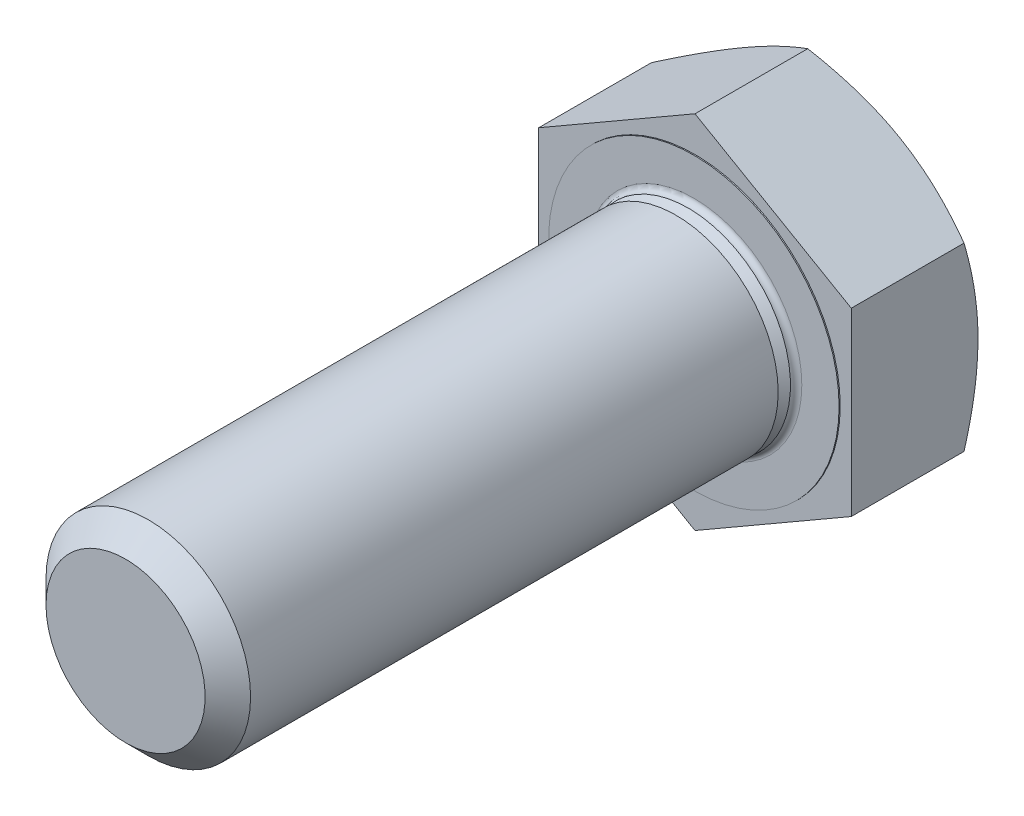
ISO-10303-21;
HEADER;
FILE_DESCRIPTION(('STEP AP214'),'2;1');
FILE_NAME('part.step','',(''),(''),'','','');
FILE_SCHEMA(('AUTOMOTIVE_DESIGN { 1 0 10303 214 1 1 1 1 }'));
ENDSEC;
DATA;
#1=APPLICATION_CONTEXT('core data for automotive mechanical design processes');
#2=APPLICATION_PROTOCOL_DEFINITION('international standard','automotive_design',2000,#1);
#3=PRODUCT_CONTEXT('',#1,'mechanical');
#4=PRODUCT('Part','Part','',(#3));
#5=PRODUCT_RELATED_PRODUCT_CATEGORY('part','',(#4));
#6=PRODUCT_DEFINITION_FORMATION('','',#4);
#7=PRODUCT_DEFINITION_CONTEXT('part definition',#1,'design');
#8=PRODUCT_DEFINITION('design','',#6,#7);
#9=PRODUCT_DEFINITION_SHAPE('','',#8);
#10=(LENGTH_UNIT() NAMED_UNIT(*) SI_UNIT(.MILLI.,.METRE.));
#11=(NAMED_UNIT(*) PLANE_ANGLE_UNIT() SI_UNIT($,.RADIAN.));
#12=(NAMED_UNIT(*) SI_UNIT($,.STERADIAN.) SOLID_ANGLE_UNIT());
#13=UNCERTAINTY_MEASURE_WITH_UNIT(LENGTH_MEASURE(1.E-05),#10,'distance_accuracy_value','');
#14=(GEOMETRIC_REPRESENTATION_CONTEXT(3) GLOBAL_UNCERTAINTY_ASSIGNED_CONTEXT((#13)) GLOBAL_UNIT_ASSIGNED_CONTEXT((#10,
#11,#12)) REPRESENTATION_CONTEXT('',''));
#15=CARTESIAN_POINT('',(0.,0.,0.));
#16=DIRECTION('',(0.,0.,1.));
#17=DIRECTION('',(1.,0.,0.));
#18=AXIS2_PLACEMENT_3D('',#15,#16,#17);
#19=CARTESIAN_POINT('',(2.13097768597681E-11,-13.7499999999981,-22.5000000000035));
#20=DIRECTION('',(0.,0.,-0.999999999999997));
#21=DIRECTION('',(-0.999999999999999,0.,0.));
#22=AXIS2_PLACEMENT_3D('',#19,#20,#21);
#23=PLANE('',#22);
#24=CARTESIAN_POINT('',(1.42030484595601E-11,0.,-22.5));
#25=DIRECTION('',(0.,0.,0.999999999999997));
#26=DIRECTION('',(0.999999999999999,0.,0.));
#27=AXIS2_PLACEMENT_3D('',#24,#25,#26);
#28=CIRCLE('',#27,27.5);
#29=CARTESIAN_POINT('',(27.5000000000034,3.55618312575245E-12,-22.4999999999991));
#30=VERTEX_POINT('',#29);
#31=CARTESIAN_POINT('',(13.7500000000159,23.8156986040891,-22.5000000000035));
#32=VERTEX_POINT('',#31);
#33=EDGE_CURVE('E115',#30,#32,#28,.T.);
#34=ORIENTED_EDGE('',*,*,#33,.F.);
#35=CARTESIAN_POINT('',(1.42030484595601E-11,0.,-22.5));
#36=DIRECTION('',(0.,0.,0.999999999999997));
#37=DIRECTION('',(0.999999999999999,0.,0.));
#38=AXIS2_PLACEMENT_3D('',#35,#36,#37);
#39=CIRCLE('',#38,27.5);
#40=CARTESIAN_POINT('',(13.7500000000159,-23.8156986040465,-22.5000000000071));
#41=VERTEX_POINT('',#40);
#42=EDGE_CURVE('E133',#41,#30,#39,.T.);
#43=ORIENTED_EDGE('',*,*,#42,.F.);
#44=CARTESIAN_POINT('',(1.42030484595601E-11,0.,-22.5));
#45=DIRECTION('',(0.,0.,0.999999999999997));
#46=DIRECTION('',(0.999999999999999,0.,0.));
#47=AXIS2_PLACEMENT_3D('',#44,#45,#46);
#48=CIRCLE('',#47,27.5);
#49=CARTESIAN_POINT('',(-13.7499999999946,-23.8156986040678,-22.4999999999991));
#50=VERTEX_POINT('',#49);
#51=EDGE_CURVE('E120',#50,#41,#48,.T.);
#52=ORIENTED_EDGE('',*,*,#51,.F.);
#53=CARTESIAN_POINT('',(1.42030484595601E-11,0.,-22.5));
#54=DIRECTION('',(0.,0.,0.999999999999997));
#55=DIRECTION('',(0.,-1.00000000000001,0.));
#56=AXIS2_PLACEMENT_3D('',#53,#54,#55);
#57=CIRCLE('',#56,27.5);
#58=CARTESIAN_POINT('',(-27.499999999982,1.78242837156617E-12,-22.5000000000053));
#59=VERTEX_POINT('',#58);
#60=EDGE_CURVE('E129',#59,#50,#57,.T.);
#61=ORIENTED_EDGE('',*,*,#60,.F.);
#62=CARTESIAN_POINT('',(1.42030484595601E-11,0.,-22.5));
#63=DIRECTION('',(0.,0.,0.999999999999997));
#64=DIRECTION('',(0.999999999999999,0.,0.));
#65=AXIS2_PLACEMENT_3D('',#62,#63,#64);
#66=CIRCLE('',#65,27.5);
#67=CARTESIAN_POINT('',(-13.7499999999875,23.8156986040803,-22.4999999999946));
#68=VERTEX_POINT('',#67);
#69=EDGE_CURVE('E130',#68,#59,#66,.T.);
#70=ORIENTED_EDGE('',*,*,#69,.F.);
#71=CARTESIAN_POINT('',(1.42030484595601E-11,0.,-22.5));
#72=DIRECTION('',(0.,0.,0.999999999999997));
#73=DIRECTION('',(0.999999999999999,0.,0.));
#74=AXIS2_PLACEMENT_3D('',#71,#72,#73);
#75=CIRCLE('',#74,27.5);
#76=EDGE_CURVE('E480',#32,#68,#75,.T.);
#77=ORIENTED_EDGE('',*,*,#76,.F.);
#78=EDGE_LOOP('',(#34,#43,#52,#61,#70,#77));
#79=FACE_BOUND('',#78,.T.);
#80=ADVANCED_FACE('F38',(#79),#23,.T.);
#81=CARTESIAN_POINT('',(7.09892214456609E-12,0.,-20.0290618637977));
#82=DIRECTION('',(0.,0.,0.999999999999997));
#83=DIRECTION('',(0.999999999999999,0.,0.));
#84=AXIS2_PLACEMENT_3D('',#81,#82,#83);
#85=CONICAL_SURFACE('',#84,31.779790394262,1.0471975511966);
#86=CARTESIAN_POINT('',(13.7500000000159,-23.8156986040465,-22.5000000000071));
#87=CARTESIAN_POINT('',(14.0418053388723,-23.6472247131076,-22.5000051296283));
#88=CARTESIAN_POINT('',(14.3336015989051,-23.4787560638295,-22.4964238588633));
#89=CARTESIAN_POINT('',(14.9170590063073,-23.1418967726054,-22.4821352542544));
#90=CARTESIAN_POINT('',(15.2087201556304,-22.9735061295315,-22.4714280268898));
#91=CARTESIAN_POINT('',(16.0831949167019,-22.4686278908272,-22.4286943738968));
#92=CARTESIAN_POINT('',(16.6656437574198,-22.1323508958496,-22.3860559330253));
#93=CARTESIAN_POINT('',(17.8256170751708,-21.4626399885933,-22.2737114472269));
#94=CARTESIAN_POINT('',(18.4031516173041,-21.1292002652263,-22.2041416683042));
#95=CARTESIAN_POINT('',(19.5554773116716,-20.4639047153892,-22.0393870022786));
#96=CARTESIAN_POINT('',(20.1302683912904,-20.1320489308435,-21.9442014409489));
#97=CARTESIAN_POINT('',(21.2758049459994,-19.4706730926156,-21.7301676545));
#98=CARTESIAN_POINT('',(21.8465544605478,-19.1411507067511,-21.6113480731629));
#99=CARTESIAN_POINT('',(22.9843587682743,-18.4842390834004,-21.3519872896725));
#100=CARTESIAN_POINT('',(23.5514133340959,-18.1568499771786,-21.2114447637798));
#101=CARTESIAN_POINT('',(24.6844797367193,-17.502673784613,-20.9099695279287));
#102=CARTESIAN_POINT('',(25.2504713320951,-17.1758983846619,-20.7489360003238));
#103=CARTESIAN_POINT('',(26.3783128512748,-16.5247387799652,-20.4091478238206));
#104=CARTESIAN_POINT('',(26.9401637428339,-16.200354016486,-20.2303974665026));
#105=CARTESIAN_POINT('',(27.5000000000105,-15.8771324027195,-20.0437990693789));
#106=B_SPLINE_CURVE_WITH_KNOTS('',3,(#86,#87,#88,#89,#90,#91,#92,#93,#94,#95,#96,#97,#98,#99,
#100,#101,#102,#103,#104,#105),.UNSPECIFIED.,.F.,.F.,(4,2,2,2,2,2,2,2,2,4),(0.,1.01080374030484,
2.02159237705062,4.04267151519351,6.0536554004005,8.06469222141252,10.0733064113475,
12.0820430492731,14.1010754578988,16.1196199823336),.UNSPECIFIED.);
#107=CARTESIAN_POINT('',(27.5000000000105,-15.8771324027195,-20.0437990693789));
#108=VERTEX_POINT('',#107);
#109=EDGE_CURVE('E140',#41,#108,#106,.T.);
#110=ORIENTED_EDGE('',*,*,#109,.F.);
#111=ORIENTED_EDGE('',*,*,#42,.T.);
#112=CARTESIAN_POINT('',(27.5000000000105,-15.8771324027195,-20.0437990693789));
#113=CARTESIAN_POINT('',(27.4999999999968,-15.2306891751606,-20.2303974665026));
#114=CARTESIAN_POINT('',(27.4999999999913,-14.5819196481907,-20.4091478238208));
#115=CARTESIAN_POINT('',(27.4999999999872,-13.2796004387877,-20.7489360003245));
#116=CARTESIAN_POINT('',(27.4999999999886,-12.626049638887,-20.9099695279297));
#117=CARTESIAN_POINT('',(27.4999999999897,-11.3176972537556,-21.2114447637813));
#118=CARTESIAN_POINT('',(27.4999999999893,-10.6629190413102,-21.3519872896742));
#119=CARTESIAN_POINT('',(27.499999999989,-9.34909579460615,-21.6113480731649));
#120=CARTESIAN_POINT('',(27.4999999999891,-8.69005102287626,-21.7301676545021));
#121=CARTESIAN_POINT('',(27.4999999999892,-7.36729934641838,-21.9442014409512));
#122=CARTESIAN_POINT('',(27.4999999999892,-6.70358777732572,-22.0393870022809));
#123=CARTESIAN_POINT('',(27.4999999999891,-5.37299667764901,-22.2041416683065));
#124=CARTESIAN_POINT('',(27.4999999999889,-4.70611723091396,-22.2737114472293));
#125=CARTESIAN_POINT('',(27.4999999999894,-3.36669541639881,-22.3860559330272));
#126=CARTESIAN_POINT('',(27.4999999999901,-2.69414142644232,-22.4286943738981));
#127=CARTESIAN_POINT('',(27.4999999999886,-1.68438494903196,-22.4714280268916));
#128=CARTESIAN_POINT('',(27.4999999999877,-1.34760366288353,-22.4821352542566));
#129=CARTESIAN_POINT('',(27.4999999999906,-0.673885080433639,-22.4964238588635));
#130=CARTESIAN_POINT('',(27.4999999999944,-0.336947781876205,-22.500005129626));
#131=CARTESIAN_POINT('',(27.5000000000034,3.55618312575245E-12,-22.4999999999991));
#132=B_SPLINE_CURVE_WITH_KNOTS('',3,(#112,#113,#114,#115,#116,#117,#118,#119,#120,#121,#122,
#123,#124,#125,#126,#127,#128,#129,#130,#131),.UNSPECIFIED.,.F.,.F.,(4,2,2,2,2,2,2,2,2,4),(0.,
2.01854452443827,4.03757693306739,6.04631357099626,8.05492776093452,10.0659645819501,
12.0769484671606,14.0980276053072,15.1088162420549,16.1196199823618),.UNSPECIFIED.);
#133=EDGE_CURVE('E142',#108,#30,#132,.T.);
#134=ORIENTED_EDGE('',*,*,#133,.F.);
#135=EDGE_LOOP('',(#110,#111,#134));
#136=FACE_BOUND('',#135,.T.);
#137=ADVANCED_FACE('F141',(#136),#85,.T.);
#138=CARTESIAN_POINT('',(7.09892214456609E-12,0.,-20.0290618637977));
#139=DIRECTION('',(0.,0.,0.999999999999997));
#140=DIRECTION('',(0.999999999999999,0.,0.));
#141=AXIS2_PLACEMENT_3D('',#138,#139,#140);
#142=CONICAL_SURFACE('',#141,31.779790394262,1.0471975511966);
#143=ORIENTED_EDGE('',*,*,#33,.T.);
#144=CARTESIAN_POINT('',(27.5000000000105,15.8771324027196,-20.0437990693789));
#145=CARTESIAN_POINT('',(26.9401637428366,16.2003540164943,-20.2303974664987));
#146=CARTESIAN_POINT('',(26.3783128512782,16.5247387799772,-20.4091478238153));
#147=CARTESIAN_POINT('',(25.2504713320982,17.175898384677,-20.7489360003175));
#148=CARTESIAN_POINT('',(24.6844797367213,17.5026737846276,-20.9099695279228));
#149=CARTESIAN_POINT('',(23.5514133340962,18.1568499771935,-21.2114447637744));
#150=CARTESIAN_POINT('',(22.984358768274,18.484239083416,-21.3519872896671));
#151=CARTESIAN_POINT('',(21.8465544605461,19.1411507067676,-21.6113480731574));
#152=CARTESIAN_POINT('',(21.2758049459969,19.4706730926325,-21.7301676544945));
#153=CARTESIAN_POINT('',(20.1302683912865,20.1320489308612,-21.9442014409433));
#154=CARTESIAN_POINT('',(19.5554773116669,20.4639047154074,-22.039387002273));
#155=CARTESIAN_POINT('',(18.4031516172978,21.1292002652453,-22.2041416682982));
#156=CARTESIAN_POINT('',(17.8256170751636,21.4626399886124,-22.2737114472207));
#157=CARTESIAN_POINT('',(16.6656437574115,22.1323508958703,-22.386055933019));
#158=CARTESIAN_POINT('',(16.0831949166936,22.4686278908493,-22.4286943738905));
#159=CARTESIAN_POINT('',(15.2087201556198,22.9735061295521,-22.4714280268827));
#160=CARTESIAN_POINT('',(14.9170590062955,23.1418967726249,-22.4821352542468));
#161=CARTESIAN_POINT('',(14.3336015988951,23.4787560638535,-22.4964238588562));
#162=CARTESIAN_POINT('',(14.0418053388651,23.6472247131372,-22.5000051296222));
#163=CARTESIAN_POINT('',(13.7500000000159,23.8156986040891,-22.5000000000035));
#164=B_SPLINE_CURVE_WITH_KNOTS('',3,(#144,#145,#146,#147,#148,#149,#150,#151,#152,#153,#154,
#155,#156,#157,#158,#159,#160,#161,#162,#163),.UNSPECIFIED.,.F.,.F.,(4,2,2,2,2,2,2,2,2,4),(0.,
2.01854452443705,4.03757693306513,6.0463135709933,8.05492776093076,10.0659645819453,
12.0769484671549,14.0980276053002,15.1088162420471,16.119619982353),.UNSPECIFIED.);
#165=CARTESIAN_POINT('',(27.5000000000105,15.8771324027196,-20.0437990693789));
#166=VERTEX_POINT('',#165);
#167=EDGE_CURVE('E262',#166,#32,#164,.T.);
#168=ORIENTED_EDGE('',*,*,#167,.F.);
#169=CARTESIAN_POINT('',(27.5000000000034,3.55618312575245E-12,-22.4999999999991));
#170=CARTESIAN_POINT('',(27.4999999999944,0.33694778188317,-22.5000051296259));
#171=CARTESIAN_POINT('',(27.4999999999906,0.673885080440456,-22.4964238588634));
#172=CARTESIAN_POINT('',(27.4999999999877,1.34760366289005,-22.4821352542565));
#173=CARTESIAN_POINT('',(27.4999999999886,1.68438494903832,-22.4714280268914));
#174=CARTESIAN_POINT('',(27.4999999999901,2.69414142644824,-22.4286943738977));
#175=CARTESIAN_POINT('',(27.4999999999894,3.36669541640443,-22.3860559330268));
#176=CARTESIAN_POINT('',(27.4999999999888,4.70611723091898,-22.2737114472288));
#177=CARTESIAN_POINT('',(27.499999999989,5.37299667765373,-22.204141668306));
#178=CARTESIAN_POINT('',(27.4999999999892,6.70358777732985,-22.0393870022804));
#179=CARTESIAN_POINT('',(27.4999999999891,7.36729934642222,-21.9442014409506));
#180=CARTESIAN_POINT('',(27.499999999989,8.69005102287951,-21.7301676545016));
#181=CARTESIAN_POINT('',(27.4999999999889,9.34909579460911,-21.6113480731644));
#182=CARTESIAN_POINT('',(27.4999999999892,10.6629190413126,-21.3519872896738));
#183=CARTESIAN_POINT('',(27.4999999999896,11.3176972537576,-21.2114447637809));
#184=CARTESIAN_POINT('',(27.4999999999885,12.6260496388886,-20.9099695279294));
#185=CARTESIAN_POINT('',(27.499999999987,13.2796004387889,-20.7489360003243));
#186=CARTESIAN_POINT('',(27.4999999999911,14.5819196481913,-20.4091478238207));
#187=CARTESIAN_POINT('',(27.4999999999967,15.2306891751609,-20.2303974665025));
#188=CARTESIAN_POINT('',(27.5000000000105,15.8771324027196,-20.0437990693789));
#189=B_SPLINE_CURVE_WITH_KNOTS('',3,(#169,#170,#171,#172,#173,#174,#175,#176,#177,#178,#179,
#180,#181,#182,#183,#184,#185,#186,#187,#188),.UNSPECIFIED.,.F.,.F.,(4,2,2,2,2,2,2,2,2,4),(0.,
1.01080374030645,2.02159237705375,4.0426715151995,6.05365540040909,8.06469222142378,
10.0733064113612,12.0820430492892,14.1010754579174,16.1196199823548),.UNSPECIFIED.);
#190=EDGE_CURVE('E151',#30,#166,#189,.T.);
#191=ORIENTED_EDGE('',*,*,#190,.F.);
#192=EDGE_LOOP('',(#143,#168,#191));
#193=FACE_BOUND('',#192,.T.);
#194=ADVANCED_FACE('F254',(#193),#142,.T.);
#195=CARTESIAN_POINT('',(7.09892214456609E-12,0.,-20.0290618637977));
#196=DIRECTION('',(0.,0.,0.999999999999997));
#197=DIRECTION('',(0.999999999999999,0.,0.));
#198=AXIS2_PLACEMENT_3D('',#195,#196,#197);
#199=CONICAL_SURFACE('',#198,31.779790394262,1.0471975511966);
#200=ORIENTED_EDGE('',*,*,#76,.T.);
#201=CARTESIAN_POINT('',(7.07810546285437E-12,31.754264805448,-20.0437990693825));
#202=CARTESIAN_POINT('',(-0.559836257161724,31.4310431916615,-20.2303974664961));
#203=CARTESIAN_POINT('',(-1.12168714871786,31.1066584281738,-20.4091478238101));
#204=CARTESIAN_POINT('',(-2.24952866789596,30.4554988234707,-20.7489360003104));
#205=CARTESIAN_POINT('',(-2.81552026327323,30.1287234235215,-20.9099695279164));
#206=CARTESIAN_POINT('',(-3.94858666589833,29.4745472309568,-21.2114447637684));
#207=CARTESIAN_POINT('',(-4.51564123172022,29.1471581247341,-21.3519872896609));
#208=CARTESIAN_POINT('',(-5.65344553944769,28.4902465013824,-21.6113480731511));
#209=CARTESIAN_POINT('',(-6.22419505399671,28.1607241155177,-21.7301676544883));
#210=CARTESIAN_POINT('',(-7.36973160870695,27.4993482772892,-21.9442014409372));
#211=CARTESIAN_POINT('',(-7.94452268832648,27.1674924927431,-22.0393870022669));
#212=CARTESIAN_POINT('',(-9.09684838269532,26.5021969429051,-22.2041416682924));
#213=CARTESIAN_POINT('',(-9.67438292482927,26.1687572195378,-22.2737114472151));
#214=CARTESIAN_POINT('',(-10.8343562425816,25.4990463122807,-22.3860559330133));
#215=CARTESIAN_POINT('',(-11.4168050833,25.1627693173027,-22.4286943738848));
#216=CARTESIAN_POINT('',(-12.2912798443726,24.657891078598,-22.4714280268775));
#217=CARTESIAN_POINT('',(-12.5829409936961,24.489500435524,-22.482135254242));
#218=CARTESIAN_POINT('',(-13.1663984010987,24.1526411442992,-22.4964238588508));
#219=CARTESIAN_POINT('',(-13.4581946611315,23.9841724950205,-22.5000051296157));
#220=CARTESIAN_POINT('',(-13.7499999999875,23.8156986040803,-22.4999999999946));
#221=B_SPLINE_CURVE_WITH_KNOTS('',3,(#201,#202,#203,#204,#205,#206,#207,#208,#209,#210,#211,
#212,#213,#214,#215,#216,#217,#218,#219,#220),.UNSPECIFIED.,.F.,.F.,(4,2,2,2,2,2,2,2,2,4),(0.,
2.01854452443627,4.03757693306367,6.04631357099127,8.05492776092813,10.0659645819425,
12.0769484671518,14.0980276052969,15.1088162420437,16.1196199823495),.UNSPECIFIED.);
#222=CARTESIAN_POINT('',(7.07810546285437E-12,31.754264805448,-20.0437990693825));
#223=VERTEX_POINT('',#222);
#224=EDGE_CURVE('E238',#223,#68,#221,.T.);
#225=ORIENTED_EDGE('',*,*,#224,.F.);
#226=CARTESIAN_POINT('',(13.7500000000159,23.8156986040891,-22.5000000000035));
#227=CARTESIAN_POINT('',(13.4581946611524,23.9841724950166,-22.5000051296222));
#228=CARTESIAN_POINT('',(13.1663984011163,24.15264114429,-22.4964238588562));
#229=CARTESIAN_POINT('',(12.5829409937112,24.4895004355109,-22.4821352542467));
#230=CARTESIAN_POINT('',(12.2912798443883,24.6578910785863,-22.4714280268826));
#231=CARTESIAN_POINT('',(11.4168050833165,25.1627693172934,-22.4286943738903));
#232=CARTESIAN_POINT('',(10.8343562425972,25.4990463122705,-22.3860559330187));
#233=CARTESIAN_POINT('',(9.67438292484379,26.1687572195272,-22.2737114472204));
#234=CARTESIAN_POINT('',(9.09684838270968,26.502196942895,-22.2041416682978));
#235=CARTESIAN_POINT('',(7.94452268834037,27.1674924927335,-22.0393870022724));
#236=CARTESIAN_POINT('',(7.36973160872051,27.4993482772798,-21.9442014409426));
#237=CARTESIAN_POINT('',(6.22419505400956,28.1607241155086,-21.7301676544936));
#238=CARTESIAN_POINT('',(5.65344553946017,28.4902465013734,-21.6113480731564));
#239=CARTESIAN_POINT('',(4.51564123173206,29.1471581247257,-21.3519872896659));
#240=CARTESIAN_POINT('',(3.94858666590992,29.4745472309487,-21.2114447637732));
#241=CARTESIAN_POINT('',(2.81552026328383,30.1287234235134,-20.9099695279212));
#242=CARTESIAN_POINT('',(2.24952866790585,30.4554988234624,-20.7489360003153));
#243=CARTESIAN_POINT('',(1.12168714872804,31.1066584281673,-20.4091478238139));
#244=CARTESIAN_POINT('',(0.559836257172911,31.4310431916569,-20.2303974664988));
#245=CARTESIAN_POINT('',(7.07810546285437E-12,31.754264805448,-20.0437990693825));
#246=B_SPLINE_CURVE_WITH_KNOTS('',3,(#226,#227,#228,#229,#230,#231,#232,#233,#234,#235,#236,
#237,#238,#239,#240,#241,#242,#243,#244,#245),.UNSPECIFIED.,.F.,.F.,(4,2,2,2,2,2,2,2,2,4),(0.,
1.01080374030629,2.02159237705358,4.04267151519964,6.05365540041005,8.06469222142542,
10.0733064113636,12.0820430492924,14.1010754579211,16.1196199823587),.UNSPECIFIED.);
#247=EDGE_CURVE('E246',#32,#223,#246,.T.);
#248=ORIENTED_EDGE('',*,*,#247,.F.);
#249=EDGE_LOOP('',(#200,#225,#248));
#250=FACE_BOUND('',#249,.T.);
#251=ADVANCED_FACE('F251',(#250),#199,.T.);
#252=CARTESIAN_POINT('',(7.09892214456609E-12,0.,-20.0290618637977));
#253=DIRECTION('',(0.,0.,0.999999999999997));
#254=DIRECTION('',(0.999999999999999,0.,0.));
#255=AXIS2_PLACEMENT_3D('',#252,#253,#254);
#256=CONICAL_SURFACE('',#255,31.779790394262,1.0471975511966);
#257=ORIENTED_EDGE('',*,*,#69,.T.);
#258=CARTESIAN_POINT('',(-27.4999999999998,15.8771324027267,-20.0437990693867));
#259=CARTESIAN_POINT('',(-27.5000000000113,15.2306891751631,-20.2303974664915));
#260=CARTESIAN_POINT('',(-27.5000000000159,14.5819196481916,-20.4091478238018));
#261=CARTESIAN_POINT('',(-27.5000000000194,13.2796004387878,-20.7489360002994));
#262=CARTESIAN_POINT('',(-27.5000000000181,12.626049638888,-20.9099695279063));
#263=CARTESIAN_POINT('',(-27.5000000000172,11.3176972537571,-21.211444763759));
#264=CARTESIAN_POINT('',(-27.5000000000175,10.6629190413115,-21.3519872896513));
#265=CARTESIAN_POINT('',(-27.5000000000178,9.34909579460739,-21.6113480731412));
#266=CARTESIAN_POINT('',(-27.5000000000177,8.69005102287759,-21.7301676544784));
#267=CARTESIAN_POINT('',(-27.5000000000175,7.36729934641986,-21.9442014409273));
#268=CARTESIAN_POINT('',(-27.5000000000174,6.70358777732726,-22.039387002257));
#269=CARTESIAN_POINT('',(-27.5000000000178,5.37299667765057,-22.204141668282));
#270=CARTESIAN_POINT('',(-27.5000000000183,4.70611723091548,-22.2737114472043));
#271=CARTESIAN_POINT('',(-27.5000000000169,3.36669541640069,-22.3860559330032));
#272=CARTESIAN_POINT('',(-27.5000000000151,2.69414142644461,-22.4286943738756));
#273=CARTESIAN_POINT('',(-27.5000000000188,1.68438494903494,-22.4714280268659));
#274=CARTESIAN_POINT('',(-27.5000000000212,1.34760366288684,-22.4821352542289));
#275=CARTESIAN_POINT('',(-27.500000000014,0.673885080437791,-22.4964238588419));
#276=CARTESIAN_POINT('',(-27.5000000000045,0.336947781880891,-22.5000051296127));
#277=CARTESIAN_POINT('',(-27.499999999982,1.78242837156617E-12,-22.5000000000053));
#278=B_SPLINE_CURVE_WITH_KNOTS('',3,(#258,#259,#260,#261,#262,#263,#264,#265,#266,#267,#268,
#269,#270,#271,#272,#273,#274,#275,#276,#277),.UNSPECIFIED.,.F.,.F.,(4,2,2,2,2,2,2,2,2,4),(0.,
2.01854452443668,4.03757693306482,6.04631357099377,8.05492776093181,10.0659645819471,
12.0769484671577,14.0980276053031,15.1088162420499,16.1196199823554),.UNSPECIFIED.);
#279=CARTESIAN_POINT('',(-27.4999999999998,15.8771324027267,-20.0437990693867));
#280=VERTEX_POINT('',#279);
#281=EDGE_CURVE('E223',#280,#59,#278,.T.);
#282=ORIENTED_EDGE('',*,*,#281,.F.);
#283=CARTESIAN_POINT('',(-13.7499999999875,23.8156986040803,-22.4999999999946));
#284=CARTESIAN_POINT('',(-14.0418053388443,23.647224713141,-22.5000051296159));
#285=CARTESIAN_POINT('',(-14.3336015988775,23.4787560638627,-22.496423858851));
#286=CARTESIAN_POINT('',(-14.9170590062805,23.1418967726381,-22.4821352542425));
#287=CARTESIAN_POINT('',(-15.2087201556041,22.9735061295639,-22.4714280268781));
#288=CARTESIAN_POINT('',(-16.083194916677,22.4686278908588,-22.4286943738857));
#289=CARTESIAN_POINT('',(-16.6656437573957,22.1323508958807,-22.3860559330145));
#290=CARTESIAN_POINT('',(-17.8256170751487,21.4626399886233,-22.2737114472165));
#291=CARTESIAN_POINT('',(-18.4031516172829,21.1292002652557,-22.204141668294));
#292=CARTESIAN_POINT('',(-19.5554773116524,20.4639047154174,-22.0393870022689));
#293=CARTESIAN_POINT('',(-20.1302683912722,20.1320489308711,-21.9442014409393));
#294=CARTESIAN_POINT('',(-21.275804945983,19.4706730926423,-21.7301676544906));
#295=CARTESIAN_POINT('',(-21.8465544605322,19.1411507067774,-21.6113480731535));
#296=CARTESIAN_POINT('',(-22.9843587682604,18.4842390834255,-21.3519872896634));
#297=CARTESIAN_POINT('',(-23.5514133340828,18.156849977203,-21.211444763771));
#298=CARTESIAN_POINT('',(-24.6844797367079,17.5026737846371,-20.909969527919));
#299=CARTESIAN_POINT('',(-25.2504713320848,17.1758983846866,-20.7489360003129));
#300=CARTESIAN_POINT('',(-26.3783128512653,16.5247387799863,-20.409147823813));
#301=CARTESIAN_POINT('',(-26.9401637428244,16.2003540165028,-20.2303974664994));
#302=CARTESIAN_POINT('',(-27.4999999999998,15.8771324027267,-20.0437990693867));
#303=B_SPLINE_CURVE_WITH_KNOTS('',3,(#283,#284,#285,#286,#287,#288,#289,#290,#291,#292,#293,
#294,#295,#296,#297,#298,#299,#300,#301,#302),.UNSPECIFIED.,.F.,.F.,(4,2,2,2,2,2,2,2,2,4),(0.,
1.01080374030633,2.0215923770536,4.0426715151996,6.05365540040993,8.06469222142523,
10.073306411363,12.0820430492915,14.1010754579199,16.119619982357),.UNSPECIFIED.);
#304=EDGE_CURVE('E231',#68,#280,#303,.T.);
#305=ORIENTED_EDGE('',*,*,#304,.F.);
#306=EDGE_LOOP('',(#257,#282,#305));
#307=FACE_BOUND('',#306,.T.);
#308=ADVANCED_FACE('F181',(#307),#256,.T.);
#309=CARTESIAN_POINT('',(7.09892214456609E-12,0.,-20.0290618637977));
#310=DIRECTION('',(0.,0.,0.999999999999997));
#311=DIRECTION('',(0.999999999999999,0.,0.));
#312=AXIS2_PLACEMENT_3D('',#309,#310,#311);
#313=CONICAL_SURFACE('',#312,31.779790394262,1.0471975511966);
#314=CARTESIAN_POINT('',(-13.7499999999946,-23.8156986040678,-22.4999999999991));
#315=CARTESIAN_POINT('',(-13.4581946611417,-23.9841724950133,-22.5000051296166));
#316=CARTESIAN_POINT('',(-13.1663984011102,-24.1526411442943,-22.4964238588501));
#317=CARTESIAN_POINT('',(-12.5829409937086,-24.4895004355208,-22.4821352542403));
#318=CARTESIAN_POINT('',(-12.2912798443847,-24.6578910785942,-22.4714280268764));
#319=CARTESIAN_POINT('',(-11.4168050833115,-25.1627693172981,-22.4286943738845));
#320=CARTESIAN_POINT('',(-10.8343562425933,-25.4990463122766,-22.3860559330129));
#321=CARTESIAN_POINT('',(-9.6743829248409,-26.1687572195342,-22.2737114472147));
#322=CARTESIAN_POINT('',(-9.09684838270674,-26.5021969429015,-22.2041416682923));
#323=CARTESIAN_POINT('',(-7.94452268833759,-27.1674924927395,-22.0393870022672));
#324=CARTESIAN_POINT('',(-7.36973160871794,-27.4993482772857,-21.9442014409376));
#325=CARTESIAN_POINT('',(-6.22419505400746,-28.1607241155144,-21.7301676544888));
#326=CARTESIAN_POINT('',(-5.65344553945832,-28.4902465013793,-21.6113480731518));
#327=CARTESIAN_POINT('',(-4.51564123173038,-29.147158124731,-21.3519872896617));
#328=CARTESIAN_POINT('',(-3.94858666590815,-29.4745472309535,-21.2114447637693));
#329=CARTESIAN_POINT('',(-2.81552026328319,-30.1287234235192,-20.9099695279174));
#330=CARTESIAN_POINT('',(-2.24952866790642,-30.4554988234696,-20.7489360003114));
#331=CARTESIAN_POINT('',(-1.12168714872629,-31.1066584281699,-20.4091478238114));
#332=CARTESIAN_POINT('',(-0.559836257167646,-31.4310431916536,-20.2303974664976));
#333=CARTESIAN_POINT('',(7.0833096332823E-12,-31.7542648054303,-20.0437990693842));
#334=B_SPLINE_CURVE_WITH_KNOTS('',3,(#314,#315,#316,#317,#318,#319,#320,#321,#322,#323,#324,
#325,#326,#327,#328,#329,#330,#331,#332,#333),.UNSPECIFIED.,.F.,.F.,(4,2,2,2,2,2,2,2,2,4),(0.,
1.01080374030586,2.02159237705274,4.04267151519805,6.05365540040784,8.06469222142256,
10.0733064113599,12.0820430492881,14.1010754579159,16.1196199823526),.UNSPECIFIED.);
#335=CARTESIAN_POINT('',(7.0833096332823E-12,-31.7542648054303,-20.0437990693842));
#336=VERTEX_POINT('',#335);
#337=EDGE_CURVE('E126',#50,#336,#334,.T.);
#338=ORIENTED_EDGE('',*,*,#337,.F.);
#339=ORIENTED_EDGE('',*,*,#51,.T.);
#340=CARTESIAN_POINT('',(7.0833096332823E-12,-31.7542648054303,-20.0437990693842));
#341=CARTESIAN_POINT('',(0.559836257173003,-31.4310431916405,-20.2303974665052));
#342=CARTESIAN_POINT('',(1.1216871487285,-31.1066584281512,-20.4091478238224));
#343=CARTESIAN_POINT('',(2.24952866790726,-30.4554988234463,-20.7489360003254));
#344=CARTESIAN_POINT('',(2.81552026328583,-30.1287234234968,-20.9099695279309));
#345=CARTESIAN_POINT('',(3.94858666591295,-29.4745472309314,-21.2114447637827));
#346=CARTESIAN_POINT('',(4.51564123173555,-29.1471581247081,-21.3519872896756));
#347=CARTESIAN_POINT('',(5.65344553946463,-28.4902465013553,-21.6113480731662));
#348=CARTESIAN_POINT('',(6.22419505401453,-28.1607241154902,-21.7301676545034));
#349=CARTESIAN_POINT('',(7.36973160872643,-27.4993482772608,-21.9442014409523));
#350=CARTESIAN_POINT('',(7.94452268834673,-27.1674924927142,-22.039387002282));
#351=CARTESIAN_POINT('',(9.09684838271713,-26.5021969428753,-22.2041416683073));
#352=CARTESIAN_POINT('',(9.67438292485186,-26.1687572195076,-22.2737114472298));
#353=CARTESIAN_POINT('',(10.8343562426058,-25.4990463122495,-22.3860559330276));
#354=CARTESIAN_POINT('',(11.4168050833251,-25.162769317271,-22.4286943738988));
#355=CARTESIAN_POINT('',(12.291279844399,-24.6578910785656,-22.4714280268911));
#356=CARTESIAN_POINT('',(12.5829409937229,-24.4895004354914,-22.4821352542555));
#357=CARTESIAN_POINT('',(13.1663984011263,-24.1526411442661,-22.4964238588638));
#358=CARTESIAN_POINT('',(13.4581946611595,-23.984172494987,-22.5000051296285));
#359=CARTESIAN_POINT('',(13.7500000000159,-23.8156986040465,-22.5000000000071));
#360=B_SPLINE_CURVE_WITH_KNOTS('',3,(#340,#341,#342,#343,#344,#345,#346,#347,#348,#349,#350,
#351,#352,#353,#354,#355,#356,#357,#358,#359),.UNSPECIFIED.,.F.,.F.,(4,2,2,2,2,2,2,2,2,4),(0.,
2.01854452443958,4.03757693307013,6.04631357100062,8.05492776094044,10.0659645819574,
12.0769484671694,14.0980276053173,15.1088162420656,16.1196199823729),.UNSPECIFIED.);
#361=EDGE_CURVE('E123',#336,#41,#360,.T.);
#362=ORIENTED_EDGE('',*,*,#361,.F.);
#363=EDGE_LOOP('',(#338,#339,#362));
#364=FACE_BOUND('',#363,.T.);
#365=ADVANCED_FACE('F121',(#364),#313,.T.);
#366=CARTESIAN_POINT('',(7.09892214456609E-12,0.,-20.0290618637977));
#367=DIRECTION('',(0.,0.,0.999999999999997));
#368=DIRECTION('',(0.,-1.00000000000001,0.));
#369=AXIS2_PLACEMENT_3D('',#366,#367,#368);
#370=CONICAL_SURFACE('',#369,31.779790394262,1.0471975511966);
#371=CARTESIAN_POINT('',(-27.499999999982,1.78242837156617E-12,-22.5000000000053));
#372=CARTESIAN_POINT('',(-27.5000000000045,-0.336947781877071,-22.5000051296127));
#373=CARTESIAN_POINT('',(-27.500000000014,-0.673885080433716,-22.496423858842));
#374=CARTESIAN_POINT('',(-27.5000000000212,-1.34760366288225,-22.482135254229));
#375=CARTESIAN_POINT('',(-27.5000000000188,-1.6843849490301,-22.4714280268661));
#376=CARTESIAN_POINT('',(-27.5000000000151,-2.69414142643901,-22.428694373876));
#377=CARTESIAN_POINT('',(-27.5000000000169,-3.36669541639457,-22.3860559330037));
#378=CARTESIAN_POINT('',(-27.5000000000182,-4.70611723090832,-22.273711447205));
#379=CARTESIAN_POINT('',(-27.5000000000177,-5.3729966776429,-22.2041416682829));
#380=CARTESIAN_POINT('',(-27.5000000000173,-6.70358777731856,-22.0393870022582));
#381=CARTESIAN_POINT('',(-27.5000000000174,-7.36729934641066,-21.9442014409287));
#382=CARTESIAN_POINT('',(-27.5000000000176,-8.69005102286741,-21.7301676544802));
#383=CARTESIAN_POINT('',(-27.5000000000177,-9.34909579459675,-21.6113480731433));
#384=CARTESIAN_POINT('',(-27.5000000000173,-10.6629190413,-21.3519872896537));
#385=CARTESIAN_POINT('',(-27.5000000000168,-11.3176972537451,-21.2114447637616));
#386=CARTESIAN_POINT('',(-27.5000000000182,-12.6260496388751,-20.9099695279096));
#387=CARTESIAN_POINT('',(-27.5000000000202,-13.2796004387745,-20.7489360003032));
#388=CARTESIAN_POINT('',(-27.5000000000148,-14.5819196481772,-20.4091478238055));
#389=CARTESIAN_POINT('',(-27.5000000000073,-15.2306891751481,-20.2303974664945));
#390=CARTESIAN_POINT('',(-27.4999999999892,-15.8771324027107,-20.0437990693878));
#391=B_SPLINE_CURVE_WITH_KNOTS('',3,(#371,#372,#373,#374,#375,#376,#377,#378,#379,#380,#381,
#382,#383,#384,#385,#386,#387,#388,#389,#390),.UNSPECIFIED.,.F.,.F.,(4,2,2,2,2,2,2,2,2,4),(0.,
1.01080374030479,2.02159237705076,4.04267151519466,6.05365540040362,8.06469222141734,
10.0733064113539,12.0820430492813,14.101075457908,16.1196199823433),.UNSPECIFIED.);
#392=CARTESIAN_POINT('',(-27.4999999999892,-15.8771324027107,-20.0437990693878));
#393=VERTEX_POINT('',#392);
#394=EDGE_CURVE('E200',#59,#393,#391,.T.);
#395=ORIENTED_EDGE('',*,*,#394,.F.);
#396=ORIENTED_EDGE('',*,*,#60,.T.);
#397=CARTESIAN_POINT('',(-27.4999999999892,-15.8771324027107,-20.0437990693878));
#398=CARTESIAN_POINT('',(-26.9401637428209,-16.2003540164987,-20.2303974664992));
#399=CARTESIAN_POINT('',(-26.3783128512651,-16.5247387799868,-20.4091478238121));
#400=CARTESIAN_POINT('',(-25.2504713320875,-17.1758983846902,-20.7489360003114));
#401=CARTESIAN_POINT('',(-24.6844797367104,-17.5026737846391,-20.9099695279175));
#402=CARTESIAN_POINT('',(-23.5514133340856,-18.1568499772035,-21.2114447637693));
#403=CARTESIAN_POINT('',(-22.9843587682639,-18.4842390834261,-21.3519872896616));
#404=CARTESIAN_POINT('',(-21.8465544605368,-19.1411507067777,-21.6113480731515));
#405=CARTESIAN_POINT('',(-21.275804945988,-19.4706730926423,-21.7301676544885));
#406=CARTESIAN_POINT('',(-20.1302683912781,-20.1320489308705,-21.9442014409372));
#407=CARTESIAN_POINT('',(-19.5554773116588,-20.4639047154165,-22.0393870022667));
#408=CARTESIAN_POINT('',(-18.4031516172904,-21.1292002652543,-22.2041416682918));
#409=CARTESIAN_POINT('',(-17.8256170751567,-21.4626399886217,-22.2737114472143));
#410=CARTESIAN_POINT('',(-16.6656437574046,-22.1323508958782,-22.3860559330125));
#411=CARTESIAN_POINT('',(-16.0831949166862,-22.4686278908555,-22.4286943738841));
#412=CARTESIAN_POINT('',(-15.2087201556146,-22.973506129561,-22.4714280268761));
#413=CARTESIAN_POINT('',(-14.9170590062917,-23.1418967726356,-22.4821352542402));
#414=CARTESIAN_POINT('',(-14.3336015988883,-23.4787560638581,-22.49642385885));
#415=CARTESIAN_POINT('',(-14.0418053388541,-23.6472247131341,-22.5000051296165));
#416=CARTESIAN_POINT('',(-13.7499999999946,-23.8156986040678,-22.4999999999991));
#417=B_SPLINE_CURVE_WITH_KNOTS('',3,(#397,#398,#399,#400,#401,#402,#403,#404,#405,#406,#407,
#408,#409,#410,#411,#412,#413,#414,#415,#416),.UNSPECIFIED.,.F.,.F.,(4,2,2,2,2,2,2,2,2,4),(0.,
2.01854452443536,4.03757693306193,6.04631357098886,8.05492776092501,10.0659645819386,
12.0769484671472,14.0980276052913,15.1088162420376,16.1196199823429),.UNSPECIFIED.);
#418=EDGE_CURVE('E195',#393,#50,#417,.T.);
#419=ORIENTED_EDGE('',*,*,#418,.F.);
#420=EDGE_LOOP('',(#395,#396,#419));
#421=FACE_BOUND('',#420,.T.);
#422=ADVANCED_FACE('F180',(#421),#370,.T.);
#423=CARTESIAN_POINT('',(13.7499999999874,-23.8156986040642,0.799999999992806));
#424=DIRECTION('',(0.499999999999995,-0.86602540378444,0.));
#425=DIRECTION('',(0.866025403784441,0.500000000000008,0.));
#426=AXIS2_PLACEMENT_3D('',#423,#424,#425);
#427=PLANE('',#426);
#428=DIRECTION('',(0.,0.,0.999999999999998));
#429=VECTOR('',#428,1.);
#430=CARTESIAN_POINT('',(-1.06715851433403E-11,-31.7542648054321,0.799999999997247));
#431=LINE('',#430,#429);
#432=CARTESIAN_POINT('',(-7.10672840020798E-12,-31.7542648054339,-0.200000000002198));
#433=VERTEX_POINT('',#432);
#434=EDGE_CURVE('E149',#336,#433,#431,.T.);
#435=ORIENTED_EDGE('',*,*,#434,.F.);
#436=ORIENTED_EDGE('',*,*,#361,.T.);
#437=ORIENTED_EDGE('',*,*,#109,.T.);
#438=DIRECTION('',(0.,0.,0.999999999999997));
#439=VECTOR('',#438,1.);
#440=CARTESIAN_POINT('',(27.499999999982,-15.8771324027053,0.800000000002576));
#441=LINE('',#440,#439);
#442=CARTESIAN_POINT('',(27.4999999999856,-15.8771324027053,-0.199999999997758));
#443=VERTEX_POINT('',#442);
#444=EDGE_CURVE('E157',#443,#108,#441,.F.);
#445=ORIENTED_EDGE('',*,*,#444,.F.);
#446=DIRECTION('',(0.866025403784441,0.500000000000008,0.));
#447=VECTOR('',#446,1.);
#448=CARTESIAN_POINT('',(-7.10672840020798E-12,-31.7542648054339,-0.200000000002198));
#449=LINE('',#448,#447);
#450=EDGE_CURVE('E411',#433,#443,#449,.T.);
#451=ORIENTED_EDGE('',*,*,#450,.F.);
#452=EDGE_LOOP('',(#435,#436,#437,#445,#451));
#453=FACE_BOUND('',#452,.T.);
#454=ADVANCED_FACE('F147',(#453),#427,.T.);
#455=CARTESIAN_POINT('',(27.4999999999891,1.06763556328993E-11,0.8000000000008));
#456=DIRECTION('',(0.999999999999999,0.,0.));
#457=DIRECTION('',(0.,1.,0.));
#458=AXIS2_PLACEMENT_3D('',#455,#456,#457);
#459=PLANE('',#458);
#460=ORIENTED_EDGE('',*,*,#444,.T.);
#461=ORIENTED_EDGE('',*,*,#133,.T.);
#462=ORIENTED_EDGE('',*,*,#190,.T.);
#463=DIRECTION('',(0.,0.,0.999999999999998));
#464=VECTOR('',#463,1.);
#465=CARTESIAN_POINT('',(27.4999999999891,15.8771324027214,0.800000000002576));
#466=LINE('',#465,#464);
#467=CARTESIAN_POINT('',(27.4999999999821,15.8771324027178,-0.199999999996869));
#468=VERTEX_POINT('',#467);
#469=EDGE_CURVE('E245',#468,#166,#466,.F.);
#470=ORIENTED_EDGE('',*,*,#469,.F.);
#471=DIRECTION('',(0.,1.00000000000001,0.));
#472=VECTOR('',#471,1.);
#473=CARTESIAN_POINT('',(27.4999999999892,-15.8812500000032,-0.199999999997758));
#474=LINE('',#473,#472);
#475=EDGE_CURVE('E415',#443,#468,#474,.T.);
#476=ORIENTED_EDGE('',*,*,#475,.F.);
#477=EDGE_LOOP('',(#460,#461,#462,#470,#476));
#478=FACE_BOUND('',#477,.T.);
#479=ADVANCED_FACE('F274',(#478),#459,.T.);
#480=CARTESIAN_POINT('',(13.7499999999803,23.8156986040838,0.799999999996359));
#481=DIRECTION('',(0.500000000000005,0.866025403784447,0.));
#482=DIRECTION('',(-0.866025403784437,0.499999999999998,0.));
#483=AXIS2_PLACEMENT_3D('',#480,#481,#482);
#484=PLANE('',#483);
#485=DIRECTION('',(-0.866025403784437,0.499999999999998,0.));
#486=VECTOR('',#485,1.);
#487=CARTESIAN_POINT('',(27.4999999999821,15.8771324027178,-0.199999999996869));
#488=LINE('',#487,#486);
#489=CARTESIAN_POINT('',(-7.10499367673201E-12,31.7542648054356,-0.20000000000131));
#490=VERTEX_POINT('',#489);
#491=EDGE_CURVE('E421',#468,#490,#488,.T.);
#492=ORIENTED_EDGE('',*,*,#491,.F.);
#493=ORIENTED_EDGE('',*,*,#469,.T.);
#494=ORIENTED_EDGE('',*,*,#167,.T.);
#495=ORIENTED_EDGE('',*,*,#247,.T.);
#496=DIRECTION('',(0.,0.,0.999999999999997));
#497=VECTOR('',#496,1.);
#498=CARTESIAN_POINT('',(-7.11887146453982E-12,31.7542648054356,0.799999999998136));
#499=LINE('',#498,#497);
#500=EDGE_CURVE('E230',#490,#223,#499,.F.);
#501=ORIENTED_EDGE('',*,*,#500,.F.);
#502=EDGE_LOOP('',(#492,#493,#494,#495,#501));
#503=FACE_BOUND('',#502,.T.);
#504=ADVANCED_FACE('F271',(#503),#484,.T.);
#505=CARTESIAN_POINT('',(-13.7500000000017,23.8156986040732,0.800000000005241));
#506=DIRECTION('',(-0.499999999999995,0.866025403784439,0.));
#507=DIRECTION('',(-0.866025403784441,-0.500000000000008,0.));
#508=AXIS2_PLACEMENT_3D('',#505,#506,#507);
#509=PLANE('',#508);
#510=DIRECTION('',(-0.866025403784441,-0.500000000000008,0.));
#511=VECTOR('',#510,1.);
#512=CARTESIAN_POINT('',(-7.10499367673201E-12,31.7542648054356,-0.20000000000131));
#513=LINE('',#512,#511);
#514=CARTESIAN_POINT('',(-27.5000000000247,15.8771324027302,-0.200000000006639));
#515=VERTEX_POINT('',#514);
#516=EDGE_CURVE('E408',#490,#515,#513,.T.);
#517=ORIENTED_EDGE('',*,*,#516,.F.);
#518=ORIENTED_EDGE('',*,*,#500,.T.);
#519=ORIENTED_EDGE('',*,*,#224,.T.);
#520=ORIENTED_EDGE('',*,*,#304,.T.);
#521=DIRECTION('',(0.,0.,0.999999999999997));
#522=VECTOR('',#521,1.);
#523=CARTESIAN_POINT('',(-27.5000000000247,15.8771324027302,0.799999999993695));
#524=LINE('',#523,#522);
#525=EDGE_CURVE('E194',#515,#280,#524,.F.);
#526=ORIENTED_EDGE('',*,*,#525,.F.);
#527=EDGE_LOOP('',(#517,#518,#519,#520,#526));
#528=FACE_BOUND('',#527,.T.);
#529=ADVANCED_FACE('F218',(#528),#509,.T.);
#530=CARTESIAN_POINT('',(-27.5000000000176,8.8930598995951E-12,0.799999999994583));
#531=DIRECTION('',(-0.999999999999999,0.,0.));
#532=DIRECTION('',(0.,0.,0.999999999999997));
#533=AXIS2_PLACEMENT_3D('',#530,#531,#532);
#534=PLANE('',#533);
#535=DIRECTION('',(0.,1.00000000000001,0.));
#536=VECTOR('',#535,1.);
#537=CARTESIAN_POINT('',(-27.5000000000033,-15.8812499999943,-0.200000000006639));
#538=LINE('',#537,#536);
#539=CARTESIAN_POINT('',(-27.4999999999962,-15.8771324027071,-0.200000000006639));
#540=VERTEX_POINT('',#539);
#541=EDGE_CURVE('E402',#515,#540,#538,.F.);
#542=ORIENTED_EDGE('',*,*,#541,.F.);
#543=ORIENTED_EDGE('',*,*,#525,.T.);
#544=ORIENTED_EDGE('',*,*,#281,.T.);
#545=ORIENTED_EDGE('',*,*,#394,.T.);
#546=DIRECTION('',(0.,0.,0.999999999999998));
#547=VECTOR('',#546,1.);
#548=CARTESIAN_POINT('',(-27.5000000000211,-15.8771324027,0.799999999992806));
#549=LINE('',#548,#547);
#550=EDGE_CURVE('E364',#540,#393,#549,.F.);
#551=ORIENTED_EDGE('',*,*,#550,.F.);
#552=EDGE_LOOP('',(#542,#543,#544,#545,#551));
#553=FACE_BOUND('',#552,.T.);
#554=ADVANCED_FACE('F211',(#553),#534,.T.);
#555=CARTESIAN_POINT('',(-13.7500000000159,-23.8156986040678,0.8000000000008));
#556=DIRECTION('',(-0.500000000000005,-0.866025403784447,0.));
#557=DIRECTION('',(0.866025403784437,-0.499999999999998,0.));
#558=AXIS2_PLACEMENT_3D('',#555,#556,#557);
#559=PLANE('',#558);
#560=ORIENTED_EDGE('',*,*,#550,.T.);
#561=ORIENTED_EDGE('',*,*,#418,.T.);
#562=ORIENTED_EDGE('',*,*,#337,.T.);
#563=ORIENTED_EDGE('',*,*,#434,.T.);
#564=DIRECTION('',(0.866025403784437,-0.499999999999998,0.));
#565=VECTOR('',#564,1.);
#566=CARTESIAN_POINT('',(-27.4999999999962,-15.8771324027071,-0.200000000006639));
#567=LINE('',#566,#565);
#568=EDGE_CURVE('E397',#540,#433,#567,.T.);
#569=ORIENTED_EDGE('',*,*,#568,.F.);
#570=EDGE_LOOP('',(#560,#561,#562,#563,#569));
#571=FACE_BOUND('',#570,.T.);
#572=ADVANCED_FACE('F206',(#571),#559,.T.);
#573=CARTESIAN_POINT('',(-1.4209553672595E-11,-15.8812499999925,-0.200000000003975));
#574=DIRECTION('',(0.,0.,0.999999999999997));
#575=DIRECTION('',(0.999999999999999,0.,0.));
#576=AXIS2_PLACEMENT_3D('',#573,#574,#575);
#577=PLANE('',#576);
#578=CARTESIAN_POINT('',(0.,0.,-0.199999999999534));
#579=DIRECTION('',(0.,0.,0.999999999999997));
#580=DIRECTION('',(0.999999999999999,0.,0.));
#581=AXIS2_PLACEMENT_3D('',#578,#579,#580);
#582=CIRCLE('',#581,25.555);
#583=CARTESIAN_POINT('',(25.555,1.53160324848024E-13,-0.19999999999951));
#584=VERTEX_POINT('',#583);
#585=EDGE_CURVE('E401',#584,#584,#582,.T.);
#586=ORIENTED_EDGE('',*,*,#585,.F.);
#587=EDGE_LOOP('',(#586));
#588=FACE_BOUND('',#587,.T.);
#589=ORIENTED_EDGE('',*,*,#541,.T.);
#590=ORIENTED_EDGE('',*,*,#568,.T.);
#591=ORIENTED_EDGE('',*,*,#450,.T.);
#592=ORIENTED_EDGE('',*,*,#475,.T.);
#593=ORIENTED_EDGE('',*,*,#491,.T.);
#594=ORIENTED_EDGE('',*,*,#516,.T.);
#595=EDGE_LOOP('',(#589,#590,#591,#592,#593,#594));
#596=FACE_BOUND('',#595,.T.);
#597=ADVANCED_FACE('F210',(#588,#596),#577,.T.);
#598=CARTESIAN_POINT('',(0.,0.,-0.350000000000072));
#599=DIRECTION('',(0.,0.,0.999999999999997));
#600=DIRECTION('',(0.999999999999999,0.,0.));
#601=AXIS2_PLACEMENT_3D('',#598,#599,#600);
#602=CYLINDRICAL_SURFACE('',#601,25.555);
#603=CARTESIAN_POINT('',(0.,0.,0.));
#604=DIRECTION('',(0.,0.,0.999999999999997));
#605=DIRECTION('',(0.999999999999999,0.,0.));
#606=AXIS2_PLACEMENT_3D('',#603,#604,#605);
#607=CIRCLE('',#606,25.555);
#608=CARTESIAN_POINT('',(25.555,1.53097495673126E-13,0.));
#609=VERTEX_POINT('',#608);
#610=EDGE_CURVE('E441',#609,#609,#607,.T.);
#611=CARTESIAN_POINT('',(25.555,1.53097495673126E-13,0.));
#612=CARTESIAN_POINT('',(25.555,1.53098150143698E-13,-0.00208333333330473));
#613=CARTESIAN_POINT('',(25.555,1.53098804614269E-13,-0.00416666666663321));
#614=CARTESIAN_POINT('',(25.555,1.53100113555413E-13,-0.00833333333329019));
#615=CARTESIAN_POINT('',(25.555,1.53100768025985E-13,-0.0104166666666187));
#616=CARTESIAN_POINT('',(25.555,1.53102076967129E-13,-0.0145833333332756));
#617=CARTESIAN_POINT('',(25.555,1.53102731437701E-13,-0.0166666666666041));
#618=CARTESIAN_POINT('',(25.555,1.53104040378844E-13,-0.020833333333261));
#619=CARTESIAN_POINT('',(25.555,1.53104694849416E-13,-0.0229166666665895));
#620=CARTESIAN_POINT('',(25.555,1.5310600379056E-13,-0.0270833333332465));
#621=CARTESIAN_POINT('',(25.555,1.53106658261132E-13,-0.029166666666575));
#622=CARTESIAN_POINT('',(25.555,1.53107967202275E-13,-0.0333333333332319));
#623=CARTESIAN_POINT('',(25.555,1.53108621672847E-13,-0.0354166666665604));
#624=CARTESIAN_POINT('',(25.555,1.53109930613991E-13,-0.0395833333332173));
#625=CARTESIAN_POINT('',(25.555,1.53110585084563E-13,-0.0416666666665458));
#626=CARTESIAN_POINT('',(25.555,1.53111894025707E-13,-0.0458333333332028));
#627=CARTESIAN_POINT('',(25.555,1.53112548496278E-13,-0.0479166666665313));
#628=CARTESIAN_POINT('',(25.555,1.53113857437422E-13,-0.0520833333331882));
#629=CARTESIAN_POINT('',(25.555,1.53114511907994E-13,-0.0541666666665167));
#630=CARTESIAN_POINT('',(25.555,1.53115820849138E-13,-0.0583333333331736));
#631=CARTESIAN_POINT('',(25.555,1.5311647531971E-13,-0.0604166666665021));
#632=CARTESIAN_POINT('',(25.555,1.53117784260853E-13,-0.0645833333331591));
#633=CARTESIAN_POINT('',(25.555,1.53118438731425E-13,-0.0666666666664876));
#634=CARTESIAN_POINT('',(25.555,1.53119747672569E-13,-0.0708333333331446));
#635=CARTESIAN_POINT('',(25.555,1.53120402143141E-13,-0.072916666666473));
#636=CARTESIAN_POINT('',(25.555,1.53121711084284E-13,-0.07708333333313));
#637=CARTESIAN_POINT('',(25.555,1.53122365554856E-13,-0.0791666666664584));
#638=CARTESIAN_POINT('',(25.555,1.53123674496E-13,-0.0833333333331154));
#639=CARTESIAN_POINT('',(25.555,1.53124328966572E-13,-0.0854166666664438));
#640=CARTESIAN_POINT('',(25.555,1.53125637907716E-13,-0.0895833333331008));
#641=CARTESIAN_POINT('',(25.555,1.53126292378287E-13,-0.0916666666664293));
#642=CARTESIAN_POINT('',(25.555,1.53127601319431E-13,-0.0958333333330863));
#643=CARTESIAN_POINT('',(25.555,1.53128255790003E-13,-0.0979166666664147));
#644=CARTESIAN_POINT('',(25.555,1.53129564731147E-13,-0.102083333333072));
#645=CARTESIAN_POINT('',(25.555,1.53130219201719E-13,-0.1041666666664));
#646=CARTESIAN_POINT('',(25.555,1.53131528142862E-13,-0.108333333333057));
#647=CARTESIAN_POINT('',(25.555,1.53132182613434E-13,-0.110416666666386));
#648=CARTESIAN_POINT('',(25.555,1.53133491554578E-13,-0.114583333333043));
#649=CARTESIAN_POINT('',(25.555,1.5313414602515E-13,-0.116666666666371));
#650=CARTESIAN_POINT('',(25.555,1.53135454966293E-13,-0.120833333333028));
#651=CARTESIAN_POINT('',(25.555,1.53136109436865E-13,-0.122916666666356));
#652=CARTESIAN_POINT('',(25.555,1.53137418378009E-13,-0.127083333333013));
#653=CARTESIAN_POINT('',(25.555,1.53138072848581E-13,-0.129166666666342));
#654=CARTESIAN_POINT('',(25.555,1.53139381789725E-13,-0.133333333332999));
#655=CARTESIAN_POINT('',(25.555,1.53140036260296E-13,-0.135416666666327));
#656=CARTESIAN_POINT('',(25.555,1.5314134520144E-13,-0.139583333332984));
#657=CARTESIAN_POINT('',(25.555,1.53141999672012E-13,-0.141666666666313));
#658=CARTESIAN_POINT('',(25.555,1.53143308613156E-13,-0.14583333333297));
#659=CARTESIAN_POINT('',(25.555,1.53143963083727E-13,-0.147916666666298));
#660=CARTESIAN_POINT('',(25.555,1.53145272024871E-13,-0.152083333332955));
#661=CARTESIAN_POINT('',(25.555,1.53145926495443E-13,-0.154166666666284));
#662=CARTESIAN_POINT('',(25.555,1.53147235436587E-13,-0.158333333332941));
#663=CARTESIAN_POINT('',(25.555,1.53147889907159E-13,-0.160416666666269));
#664=CARTESIAN_POINT('',(25.555,1.53149198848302E-13,-0.164583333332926));
#665=CARTESIAN_POINT('',(25.555,1.53149853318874E-13,-0.166666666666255));
#666=CARTESIAN_POINT('',(25.555,1.53151162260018E-13,-0.170833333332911));
#667=CARTESIAN_POINT('',(25.555,1.5315181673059E-13,-0.17291666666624));
#668=CARTESIAN_POINT('',(25.555,1.53153125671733E-13,-0.177083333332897));
#669=CARTESIAN_POINT('',(25.555,1.53153780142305E-13,-0.179166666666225));
#670=CARTESIAN_POINT('',(25.555,1.53155089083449E-13,-0.183333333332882));
#671=CARTESIAN_POINT('',(25.555,1.53155743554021E-13,-0.185416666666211));
#672=CARTESIAN_POINT('',(25.555,1.53157052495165E-13,-0.189583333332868));
#673=CARTESIAN_POINT('',(25.555,1.53157706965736E-13,-0.191666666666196));
#674=CARTESIAN_POINT('',(25.555,1.5315901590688E-13,-0.195833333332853));
#675=CARTESIAN_POINT('',(25.555,1.53159670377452E-13,-0.197916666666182));
#676=CARTESIAN_POINT('',(25.555,1.53160324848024E-13,-0.19999999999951));
#677=B_SPLINE_CURVE_WITH_KNOTS('',3,(#611,#612,#613,#614,#615,#616,#617,#618,#619,#620,#621,
#622,#623,#624,#625,#626,#627,#628,#629,#630,#631,#632,#633,#634,#635,#636,#637,#638,#639,#640,
#641,#642,#643,#644,#645,#646,#647,#648,#649,#650,#651,#652,#653,#654,#655,#656,#657,#658,#659,
#660,#661,#662,#663,#664,#665,#666,#667,#668,#669,#670,#671,#672,#673,#674,#675,#676),
.UNSPECIFIED.,.F.,.F.,(4,2,2,2,2,2,2,2,2,2,2,2,2,2,2,2,2,2,2,2,2,2,2,2,2,2,2,2,2,2,2,2,4),(0.,
0.00624999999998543,0.0124999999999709,0.0187499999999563,0.0249999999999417,0.0312499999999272,
0.0374999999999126,0.043749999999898,0.0499999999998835,0.0562499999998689,0.0624999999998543,
0.0687499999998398,0.0749999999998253,0.0812499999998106,0.0874999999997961,0.0937499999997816,
0.0999999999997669,0.106249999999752,0.112499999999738,0.118749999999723,0.124999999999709,
0.131249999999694,0.13749999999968,0.143749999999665,0.14999999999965,0.156249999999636,
0.162499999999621,0.168749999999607,0.174999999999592,0.181249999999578,0.187499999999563,
0.193749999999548,0.199999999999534),.UNSPECIFIED.);
#678=EDGE_CURVE('BSEAM448',#609,#584,#677,.T.);
#679=ORIENTED_EDGE('',*,*,#610,.F.);
#680=ORIENTED_EDGE('',*,*,#585,.T.);
#681=ORIENTED_EDGE('',*,*,#678,.T.);
#682=ORIENTED_EDGE('',*,*,#678,.F.);
#683=EDGE_LOOP('',(#679,#681,#680,#682));
#684=FACE_BOUND('',#683,.T.);
#685=ADVANCED_FACE('F448',(#684),#602,.T.);
#686=CARTESIAN_POINT('',(-7.10412631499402E-12,22.2775000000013,-6.21724893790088E-12));
#687=DIRECTION('',(0.,0.,0.999999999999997));
#688=DIRECTION('',(0.,-1.00000000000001,0.));
#689=AXIS2_PLACEMENT_3D('',#686,#687,#688);
#690=PLANE('',#689);
#691=ORIENTED_EDGE('',*,*,#610,.T.);
#692=EDGE_LOOP('',(#691));
#693=FACE_BOUND('',#692,.T.);
#694=CARTESIAN_POINT('',(0.,5.33458883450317E-12,1.20324757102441E-12));
#695=DIRECTION('',(0.,0.,0.999999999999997));
#696=DIRECTION('',(1.,-1.86881046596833E-13,0.));
#697=AXIS2_PLACEMENT_3D('',#694,#695,#696);
#698=CIRCLE('',#697,18.999999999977);
#699=CARTESIAN_POINT('',(-7.10499367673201E-12,19.000000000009,-1.77635683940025E-12));
#700=VERTEX_POINT('',#699);
#701=CARTESIAN_POINT('',(18.999999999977,7.1201725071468E-12,1.77635683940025E-12));
#702=VERTEX_POINT('',#701);
#703=EDGE_CURVE('E56',#700,#702,#698,.F.);
#704=ORIENTED_EDGE('',*,*,#703,.T.);
#705=CARTESIAN_POINT('',(0.,5.33458883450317E-12,1.21365591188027E-12));
#706=DIRECTION('',(0.,0.,0.999999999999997));
#707=DIRECTION('',(-1.,1.87003511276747E-13,0.));
#708=AXIS2_PLACEMENT_3D('',#705,#706,#707);
#709=CIRCLE('',#708,18.999999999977);
#710=CARTESIAN_POINT('',(-19.0000000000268,-3.54837687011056E-12,-4.44089209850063E-12));
#711=VERTEX_POINT('',#710);
#712=EDGE_CURVE('E342',#702,#711,#709,.F.);
#713=ORIENTED_EDGE('',*,*,#712,.T.);
#714=CARTESIAN_POINT('',(0.,5.33458883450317E-12,1.20845174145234E-12));
#715=DIRECTION('',(0.,0.,0.999999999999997));
#716=DIRECTION('',(1.87164323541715E-13,1.,0.));
#717=AXIS2_PLACEMENT_3D('',#714,#715,#716);
#718=CIRCLE('',#717,18.9999999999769);
#719=EDGE_CURVE('E324',#711,#700,#718,.F.);
#720=ORIENTED_EDGE('',*,*,#719,.T.);
#721=EDGE_LOOP('',(#704,#713,#720));
#722=FACE_BOUND('',#721,.T.);
#723=ADVANCED_FACE('F309',(#693,#722),#690,.T.);
#724=CARTESIAN_POINT('',(0.,5.33427468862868E-12,1.0000000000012));
#725=DIRECTION('',(0.,0.,0.999999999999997));
#726=DIRECTION('',(1.,-1.86847978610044E-13,0.));
#727=AXIS2_PLACEMENT_3D('',#724,#725,#726);
#728=TOROIDAL_SURFACE('',#727,18.999999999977,1.);
#729=CARTESIAN_POINT('',(0.,5.33427468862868E-12,1.00000000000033));
#730=DIRECTION('',(0.,0.,-0.999999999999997));
#731=DIRECTION('',(0.,1.00000000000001,0.));
#732=AXIS2_PLACEMENT_3D('',#729,#730,#731);
#733=CIRCLE('',#732,18.);
#734=CARTESIAN_POINT('',(-18.,5.22636101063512E-12,1.00000000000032));
#735=VERTEX_POINT('',#734);
#736=EDGE_CURVE('E317',#735,#735,#733,.F.);
#737=ORIENTED_EDGE('',*,*,#736,.F.);
#738=EDGE_LOOP('',(#737));
#739=FACE_BOUND('',#738,.T.);
#740=ORIENTED_EDGE('',*,*,#712,.F.);
#741=ORIENTED_EDGE('',*,*,#703,.F.);
#742=ORIENTED_EDGE('',*,*,#719,.F.);
#743=EDGE_LOOP('',(#740,#741,#742));
#744=FACE_BOUND('',#743,.T.);
#745=ADVANCED_FACE('F303',(#739,#744),#728,.F.);
#746=CARTESIAN_POINT('',(0.,5.33427468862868E-12,1.00000000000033));
#747=DIRECTION('',(0.,0.,-0.999999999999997));
#748=DIRECTION('',(-0.999999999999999,0.,0.));
#749=AXIS2_PLACEMENT_3D('',#746,#747,#748);
#750=CONICAL_SURFACE('',#749,18.,0.785398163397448);
#751=CARTESIAN_POINT('',(-7.105427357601E-12,5.32907051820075E-12,3.16500000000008));
#752=DIRECTION('',(0.,0.,-0.999999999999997));
#753=DIRECTION('',(-0.999999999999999,0.,0.));
#754=AXIS2_PLACEMENT_3D('',#751,#752,#753);
#755=CIRCLE('',#754,15.835);
#756=CARTESIAN_POINT('',(-15.8350000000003,5.23866050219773E-12,3.16500000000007));
#757=VERTEX_POINT('',#756);
#758=EDGE_CURVE('E321',#757,#757,#755,.F.);
#759=CARTESIAN_POINT('',(-15.8350000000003,5.23866050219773E-12,3.16500000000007));
#760=CARTESIAN_POINT('',(-15.8575520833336,5.23853238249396E-12,3.14244791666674));
#761=CARTESIAN_POINT('',(-15.8801041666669,5.23840426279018E-12,3.11989583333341));
#762=CARTESIAN_POINT('',(-15.9252083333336,5.23814802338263E-12,3.07479166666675));
#763=CARTESIAN_POINT('',(-15.9477604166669,5.23801990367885E-12,3.05223958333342));
#764=CARTESIAN_POINT('',(-15.9928645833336,5.23776366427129E-12,3.00713541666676));
#765=CARTESIAN_POINT('',(-16.0154166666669,5.23763554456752E-12,2.98458333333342));
#766=CARTESIAN_POINT('',(-16.0605208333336,5.23737930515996E-12,2.93947916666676));
#767=CARTESIAN_POINT('',(-16.0830729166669,5.23725118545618E-12,2.91692708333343));
#768=CARTESIAN_POINT('',(-16.1281770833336,5.23699494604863E-12,2.87182291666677));
#769=CARTESIAN_POINT('',(-16.1507291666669,5.23686682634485E-12,2.84927083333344));
#770=CARTESIAN_POINT('',(-16.1958333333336,5.2366105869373E-12,2.80416666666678));
#771=CARTESIAN_POINT('',(-16.2183854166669,5.23648246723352E-12,2.78161458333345));
#772=CARTESIAN_POINT('',(-16.2634895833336,5.23622622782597E-12,2.73651041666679));
#773=CARTESIAN_POINT('',(-16.2860416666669,5.23609810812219E-12,2.71395833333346));
#774=CARTESIAN_POINT('',(-16.3311458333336,5.23584186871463E-12,2.66885416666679));
#775=CARTESIAN_POINT('',(-16.3536979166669,5.23571374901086E-12,2.64630208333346));
#776=CARTESIAN_POINT('',(-16.3988020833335,5.2354575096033E-12,2.6011979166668));
#777=CARTESIAN_POINT('',(-16.4213541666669,5.23532938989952E-12,2.57864583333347));
#778=CARTESIAN_POINT('',(-16.4664583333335,5.23507315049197E-12,2.53354166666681));
#779=CARTESIAN_POINT('',(-16.4890104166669,5.23494503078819E-12,2.51098958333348));
#780=CARTESIAN_POINT('',(-16.5341145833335,5.23468879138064E-12,2.46588541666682));
#781=CARTESIAN_POINT('',(-16.5566666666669,5.23456067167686E-12,2.44333333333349));
#782=CARTESIAN_POINT('',(-16.6017708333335,5.23430443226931E-12,2.39822916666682));
#783=CARTESIAN_POINT('',(-16.6243229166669,5.23417631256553E-12,2.37567708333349));
#784=CARTESIAN_POINT('',(-16.6694270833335,5.23392007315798E-12,2.33057291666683));
#785=CARTESIAN_POINT('',(-16.6919791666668,5.2337919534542E-12,2.3080208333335));
#786=CARTESIAN_POINT('',(-16.7370833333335,5.23353571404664E-12,2.26291666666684));
#787=CARTESIAN_POINT('',(-16.7596354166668,5.23340759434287E-12,2.24036458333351));
#788=CARTESIAN_POINT('',(-16.8047395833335,5.23315135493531E-12,2.19526041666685));
#789=CARTESIAN_POINT('',(-16.8272916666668,5.23302323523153E-12,2.17270833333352));
#790=CARTESIAN_POINT('',(-16.8723958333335,5.23276699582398E-12,2.12760416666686));
#791=CARTESIAN_POINT('',(-16.8949479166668,5.2326388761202E-12,2.10505208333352));
#792=CARTESIAN_POINT('',(-16.9400520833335,5.23238263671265E-12,2.05994791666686));
#793=CARTESIAN_POINT('',(-16.9626041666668,5.23225451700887E-12,2.03739583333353));
#794=CARTESIAN_POINT('',(-17.0077083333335,5.23199827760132E-12,1.99229166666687));
#795=CARTESIAN_POINT('',(-17.0302604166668,5.23187015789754E-12,1.96973958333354));
#796=CARTESIAN_POINT('',(-17.0753645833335,5.23161391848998E-12,1.92463541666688));
#797=CARTESIAN_POINT('',(-17.0979166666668,5.23148579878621E-12,1.90208333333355));
#798=CARTESIAN_POINT('',(-17.1430208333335,5.23122955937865E-12,1.85697916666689));
#799=CARTESIAN_POINT('',(-17.1655729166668,5.23110143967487E-12,1.83442708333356));
#800=CARTESIAN_POINT('',(-17.2106770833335,5.23084520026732E-12,1.78932291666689));
#801=CARTESIAN_POINT('',(-17.2332291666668,5.23071708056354E-12,1.76677083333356));
#802=CARTESIAN_POINT('',(-17.2783333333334,5.23046084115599E-12,1.7216666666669));
#803=CARTESIAN_POINT('',(-17.3008854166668,5.23033272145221E-12,1.69911458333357));
#804=CARTESIAN_POINT('',(-17.3459895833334,5.23007648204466E-12,1.65401041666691));
#805=CARTESIAN_POINT('',(-17.3685416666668,5.22994836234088E-12,1.63145833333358));
#806=CARTESIAN_POINT('',(-17.4136458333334,5.22969212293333E-12,1.58635416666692));
#807=CARTESIAN_POINT('',(-17.4361979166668,5.22956400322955E-12,1.56380208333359));
#808=CARTESIAN_POINT('',(-17.4813020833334,5.22930776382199E-12,1.51869791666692));
#809=CARTESIAN_POINT('',(-17.5038541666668,5.22917964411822E-12,1.49614583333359));
#810=CARTESIAN_POINT('',(-17.5489583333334,5.22892340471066E-12,1.45104166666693));
#811=CARTESIAN_POINT('',(-17.5715104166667,5.22879528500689E-12,1.4284895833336));
#812=CARTESIAN_POINT('',(-17.6166145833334,5.22853904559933E-12,1.38338541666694));
#813=CARTESIAN_POINT('',(-17.6391666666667,5.22841092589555E-12,1.36083333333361));
#814=CARTESIAN_POINT('',(-17.6842708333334,5.228154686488E-12,1.31572916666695));
#815=CARTESIAN_POINT('',(-17.7068229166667,5.22802656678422E-12,1.29317708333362));
#816=CARTESIAN_POINT('',(-17.7519270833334,5.22777032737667E-12,1.24807291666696));
#817=CARTESIAN_POINT('',(-17.7744791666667,5.22764220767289E-12,1.22552083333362));
#818=CARTESIAN_POINT('',(-17.8195833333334,5.22738596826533E-12,1.18041666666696));
#819=CARTESIAN_POINT('',(-17.8421354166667,5.22725784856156E-12,1.15786458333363));
#820=CARTESIAN_POINT('',(-17.8872395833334,5.227001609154E-12,1.11276041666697));
#821=CARTESIAN_POINT('',(-17.9097916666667,5.22687348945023E-12,1.09020833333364));
#822=CARTESIAN_POINT('',(-17.9548958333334,5.22661725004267E-12,1.04510416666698));
#823=CARTESIAN_POINT('',(-17.9774479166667,5.22648913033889E-12,1.02255208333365));
#824=CARTESIAN_POINT('',(-18.,5.22636101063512E-12,1.00000000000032));
#825=B_SPLINE_CURVE_WITH_KNOTS('',3,(#759,#760,#761,#762,#763,#764,#765,#766,#767,#768,#769,
#770,#771,#772,#773,#774,#775,#776,#777,#778,#779,#780,#781,#782,#783,#784,#785,#786,#787,#788,
#789,#790,#791,#792,#793,#794,#795,#796,#797,#798,#799,#800,#801,#802,#803,#804,#805,#806,#807,
#808,#809,#810,#811,#812,#813,#814,#815,#816,#817,#818,#819,#820,#821,#822,#823,#824),
.UNSPECIFIED.,.F.,.F.,(4,2,2,2,2,2,2,2,2,2,2,2,2,2,2,2,2,2,2,2,2,2,2,2,2,2,2,2,2,2,2,2,4),(0.,
0.0956803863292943,0.191360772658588,0.287041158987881,0.382721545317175,0.478401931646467,
0.57408231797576,0.669762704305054,0.765443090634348,0.861123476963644,0.956803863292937,
1.05248424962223,1.14816463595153,1.24384502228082,1.33952540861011,1.43520579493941,
1.5308861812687,1.62656656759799,1.72224695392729,1.81792734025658,1.91360772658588,
2.00928811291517,2.10496849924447,2.20064888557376,2.29632927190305,2.39200965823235,
2.48769004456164,2.58337043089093,2.67905081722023,2.77473120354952,2.87041158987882,
2.96609197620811,3.0617723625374),.UNSPECIFIED.);
#826=EDGE_CURVE('BSEAM296',#757,#735,#825,.T.);
#827=ORIENTED_EDGE('',*,*,#758,.F.);
#828=ORIENTED_EDGE('',*,*,#736,.T.);
#829=ORIENTED_EDGE('',*,*,#826,.T.);
#830=ORIENTED_EDGE('',*,*,#826,.F.);
#831=EDGE_LOOP('',(#827,#829,#828,#830));
#832=FACE_BOUND('',#831,.T.);
#833=ADVANCED_FACE('F296',(#832),#750,.T.);
#834=CARTESIAN_POINT('',(-1.42173599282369E-11,16.9175000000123,3.16500000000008));
#835=DIRECTION('',(0.,0.,-0.999999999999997));
#836=DIRECTION('',(0.,1.00000000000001,0.));
#837=AXIS2_PLACEMENT_3D('',#834,#835,#836);
#838=PLANE('',#837);
#839=ORIENTED_EDGE('',*,*,#758,.T.);
#840=EDGE_LOOP('',(#839));
#841=FACE_BOUND('',#840,.T.);
#842=CARTESIAN_POINT('',(-7.105427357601E-12,5.32907051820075E-12,3.16500000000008));
#843=DIRECTION('',(0.,0.,0.999999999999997));
#844=DIRECTION('',(0.999999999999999,0.,0.));
#845=AXIS2_PLACEMENT_3D('',#842,#843,#844);
#846=CIRCLE('',#845,18.);
#847=CARTESIAN_POINT('',(18.0000000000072,1.07898098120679E-11,3.16500000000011));
#848=VERTEX_POINT('',#847);
#849=EDGE_CURVE('E434',#848,#848,#846,.T.);
#850=ORIENTED_EDGE('',*,*,#849,.F.);
#851=EDGE_LOOP('',(#850));
#852=FACE_BOUND('',#851,.T.);
#853=ADVANCED_FACE('F287',(#841,#852),#838,.T.);
#854=CARTESIAN_POINT('',(7.09718742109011E-12,1.06607431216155E-11,70.5));
#855=DIRECTION('',(0.,0.,0.999999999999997));
#856=DIRECTION('',(0.999999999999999,0.,0.));
#857=AXIS2_PLACEMENT_3D('',#854,#855,#856);
#858=CYLINDRICAL_SURFACE('',#857,18.);
#859=CARTESIAN_POINT('',(1.4209987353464E-11,3.5527136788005E-12,96.0000000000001));
#860=DIRECTION('',(0.,0.,-0.999999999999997));
#861=DIRECTION('',(-0.999999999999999,0.,0.));
#862=AXIS2_PLACEMENT_3D('',#859,#860,#861);
#863=CIRCLE('',#862,18.);
#864=CARTESIAN_POINT('',(18.0000000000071,1.07606460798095E-11,96.0000000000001));
#865=VERTEX_POINT('',#864);
#866=EDGE_CURVE('E11',#865,#865,#863,.T.);
#867=CARTESIAN_POINT('',(18.0000000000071,1.07606460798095E-11,96.0000000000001));
#868=CARTESIAN_POINT('',(18.0000000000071,1.07609498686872E-11,95.0329687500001));
#869=CARTESIAN_POINT('',(18.0000000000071,1.07612536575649E-11,94.0659375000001));
#870=CARTESIAN_POINT('',(18.0000000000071,1.07618612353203E-11,92.1318750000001));
#871=CARTESIAN_POINT('',(18.0000000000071,1.0762165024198E-11,91.1648437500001));
#872=CARTESIAN_POINT('',(18.0000000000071,1.07627726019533E-11,89.2307812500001));
#873=CARTESIAN_POINT('',(18.0000000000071,1.0763076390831E-11,88.2637500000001));
#874=CARTESIAN_POINT('',(18.0000000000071,1.07636839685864E-11,86.3296875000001));
#875=CARTESIAN_POINT('',(18.0000000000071,1.07639877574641E-11,85.3626562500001));
#876=CARTESIAN_POINT('',(18.0000000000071,1.07645953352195E-11,83.4285937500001));
#877=CARTESIAN_POINT('',(18.0000000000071,1.07648991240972E-11,82.4615625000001));
#878=CARTESIAN_POINT('',(18.0000000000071,1.07655067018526E-11,80.5275000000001));
#879=CARTESIAN_POINT('',(18.0000000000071,1.07658104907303E-11,79.5604687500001));
#880=CARTESIAN_POINT('',(18.0000000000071,1.07664180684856E-11,77.6264062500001));
#881=CARTESIAN_POINT('',(18.0000000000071,1.07667218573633E-11,76.6593750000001));
#882=CARTESIAN_POINT('',(18.0000000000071,1.07673294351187E-11,74.7253125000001));
#883=CARTESIAN_POINT('',(18.0000000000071,1.07676332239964E-11,73.7582812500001));
#884=CARTESIAN_POINT('',(18.0000000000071,1.07682408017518E-11,71.8242187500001));
#885=CARTESIAN_POINT('',(18.0000000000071,1.07685445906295E-11,70.8571875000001));
#886=CARTESIAN_POINT('',(18.0000000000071,1.07691521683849E-11,68.9231250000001));
#887=CARTESIAN_POINT('',(18.0000000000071,1.07694559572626E-11,67.9560937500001));
#888=CARTESIAN_POINT('',(18.0000000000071,1.07700635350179E-11,66.0220312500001));
#889=CARTESIAN_POINT('',(18.0000000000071,1.07703673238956E-11,65.0550000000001));
#890=CARTESIAN_POINT('',(18.0000000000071,1.0770974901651E-11,63.1209375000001));
#891=CARTESIAN_POINT('',(18.0000000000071,1.07712786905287E-11,62.1539062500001));
#892=CARTESIAN_POINT('',(18.0000000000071,1.07718862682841E-11,60.2198437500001));
#893=CARTESIAN_POINT('',(18.0000000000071,1.07721900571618E-11,59.2528125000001));
#894=CARTESIAN_POINT('',(18.0000000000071,1.07727976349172E-11,57.3187500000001));
#895=CARTESIAN_POINT('',(18.0000000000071,1.07731014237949E-11,56.3517187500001));
#896=CARTESIAN_POINT('',(18.0000000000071,1.07737090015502E-11,54.4176562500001));
#897=CARTESIAN_POINT('',(18.0000000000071,1.07740127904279E-11,53.4506250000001));
#898=CARTESIAN_POINT('',(18.0000000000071,1.07746203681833E-11,51.5165625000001));
#899=CARTESIAN_POINT('',(18.0000000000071,1.0774924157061E-11,50.5495312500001));
#900=CARTESIAN_POINT('',(18.0000000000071,1.07755317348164E-11,48.6154687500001));
#901=CARTESIAN_POINT('',(18.0000000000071,1.07758355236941E-11,47.6484375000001));
#902=CARTESIAN_POINT('',(18.0000000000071,1.07764431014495E-11,45.7143750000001));
#903=CARTESIAN_POINT('',(18.0000000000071,1.07767468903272E-11,44.7473437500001));
#904=CARTESIAN_POINT('',(18.0000000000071,1.07773544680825E-11,42.8132812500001));
#905=CARTESIAN_POINT('',(18.0000000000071,1.07776582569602E-11,41.8462500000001));
#906=CARTESIAN_POINT('',(18.0000000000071,1.07782658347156E-11,39.9121875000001));
#907=CARTESIAN_POINT('',(18.0000000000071,1.07785696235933E-11,38.9451562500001));
#908=CARTESIAN_POINT('',(18.0000000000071,1.07791772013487E-11,37.0110937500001));
#909=CARTESIAN_POINT('',(18.0000000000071,1.07794809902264E-11,36.0440625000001));
#910=CARTESIAN_POINT('',(18.0000000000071,1.07800885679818E-11,34.1100000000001));
#911=CARTESIAN_POINT('',(18.0000000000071,1.07803923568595E-11,33.1429687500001));
#912=CARTESIAN_POINT('',(18.0000000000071,1.07809999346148E-11,31.2089062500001));
#913=CARTESIAN_POINT('',(18.0000000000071,1.07813037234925E-11,30.2418750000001));
#914=CARTESIAN_POINT('',(18.0000000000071,1.07819113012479E-11,28.3078125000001));
#915=CARTESIAN_POINT('',(18.0000000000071,1.07822150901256E-11,27.3407812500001));
#916=CARTESIAN_POINT('',(18.0000000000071,1.0782822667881E-11,25.4067187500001));
#917=CARTESIAN_POINT('',(18.0000000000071,1.07831264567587E-11,24.4396875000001));
#918=CARTESIAN_POINT('',(18.0000000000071,1.07837340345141E-11,22.5056250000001));
#919=CARTESIAN_POINT('',(18.0000000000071,1.07840378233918E-11,21.5385937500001));
#920=CARTESIAN_POINT('',(18.0000000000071,1.07846454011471E-11,19.6045312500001));
#921=CARTESIAN_POINT('',(18.0000000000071,1.07849491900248E-11,18.6375000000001));
#922=CARTESIAN_POINT('',(18.0000000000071,1.07855567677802E-11,16.7034375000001));
#923=CARTESIAN_POINT('',(18.0000000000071,1.07858605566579E-11,15.7364062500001));
#924=CARTESIAN_POINT('',(18.0000000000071,1.07864681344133E-11,13.8023437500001));
#925=CARTESIAN_POINT('',(18.0000000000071,1.0786771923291E-11,12.8353125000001));
#926=CARTESIAN_POINT('',(18.0000000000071,1.07873795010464E-11,10.9012500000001));
#927=CARTESIAN_POINT('',(18.0000000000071,1.07876832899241E-11,9.93421875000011));
#928=CARTESIAN_POINT('',(18.0000000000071,1.07882908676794E-11,8.0001562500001));
#929=CARTESIAN_POINT('',(18.0000000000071,1.07885946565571E-11,7.0331250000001));
#930=CARTESIAN_POINT('',(18.0000000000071,1.07892022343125E-11,5.0990625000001));
#931=CARTESIAN_POINT('',(18.0000000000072,1.07895060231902E-11,4.13203125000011));
#932=CARTESIAN_POINT('',(18.0000000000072,1.07898098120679E-11,3.16500000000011));
#933=B_SPLINE_CURVE_WITH_KNOTS('',3,(#867,#868,#869,#870,#871,#872,#873,#874,#875,#876,#877,
#878,#879,#880,#881,#882,#883,#884,#885,#886,#887,#888,#889,#890,#891,#892,#893,#894,#895,#896,
#897,#898,#899,#900,#901,#902,#903,#904,#905,#906,#907,#908,#909,#910,#911,#912,#913,#914,#915,
#916,#917,#918,#919,#920,#921,#922,#923,#924,#925,#926,#927,#928,#929,#930,#931,#932),
.UNSPECIFIED.,.F.,.F.,(4,2,2,2,2,2,2,2,2,2,2,2,2,2,2,2,2,2,2,2,2,2,2,2,2,2,2,2,2,2,2,2,4),(0.,
2.90109375,5.8021875,8.70328125,11.604375,14.50546875,17.4065625,20.30765625,23.20875,
26.10984375,29.0109375,31.91203125,34.813125,37.71421875,40.6153125,43.51640625,46.4175,
49.31859375,52.2196875,55.12078125,58.021875,60.92296875,63.8240625,66.72515625,69.62625,
72.52734375,75.4284375,78.32953125,81.230625,84.13171875,87.0328125,89.93390625,92.835),.UNSPECIFIED.);
#934=EDGE_CURVE('BSEAM284',#865,#848,#933,.T.);
#935=ORIENTED_EDGE('',*,*,#866,.T.);
#936=ORIENTED_EDGE('',*,*,#849,.T.);
#937=ORIENTED_EDGE('',*,*,#934,.T.);
#938=ORIENTED_EDGE('',*,*,#934,.F.);
#939=EDGE_LOOP('',(#935,#937,#936,#938));
#940=FACE_BOUND('',#939,.T.);
#941=ADVANCED_FACE('F284',(#940),#858,.T.);
#942=CARTESIAN_POINT('',(-27.5001030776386,31.6759162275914,99.9999999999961));
#943=DIRECTION('',(0.,0.,-0.999999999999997));
#944=DIRECTION('',(-0.999999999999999,0.,0.));
#945=AXIS2_PLACEMENT_3D('',#942,#943,#944);
#946=PLANE('',#945);
#947=CARTESIAN_POINT('',(1.4210854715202E-11,3.5527136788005E-12,99.9999999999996));
#948=DIRECTION('',(0.,0.,-0.999999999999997));
#949=DIRECTION('',(-0.999999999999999,0.,0.));
#950=AXIS2_PLACEMENT_3D('',#947,#948,#949);
#951=CIRCLE('',#950,14.);
#952=CARTESIAN_POINT('',(-13.9999999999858,3.46878081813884E-12,99.9999999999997));
#953=VERTEX_POINT('',#952);
#954=EDGE_CURVE('E48',#953,#953,#951,.F.);
#955=ORIENTED_EDGE('',*,*,#954,.T.);
#956=EDGE_LOOP('',(#955));
#957=FACE_BOUND('',#956,.T.);
#958=ADVANCED_FACE('F286',(#957),#946,.F.);
#959=CARTESIAN_POINT('',(1.4210854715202E-11,3.5527136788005E-12,99.9999999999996));
#960=DIRECTION('',(0.,0.,-0.999999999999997));
#961=DIRECTION('',(-0.999999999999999,0.,0.));
#962=AXIS2_PLACEMENT_3D('',#959,#960,#961);
#963=CONICAL_SURFACE('',#962,14.,0.785398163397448);
#964=ORIENTED_EDGE('',*,*,#866,.F.);
#965=EDGE_LOOP('',(#964));
#966=FACE_BOUND('',#965,.T.);
#967=ORIENTED_EDGE('',*,*,#954,.F.);
#968=EDGE_LOOP('',(#967));
#969=FACE_BOUND('',#968,.T.);
#970=ADVANCED_FACE('F40',(#966,#969),#963,.T.);
#971=CLOSED_SHELL('',(#80,#137,#194,#251,#308,#365,#422,#454,#479,#504,#529,#554,#572,#597,#685,
#723,#745,#833,#853,#941,#958,#970));
#972=MANIFOLD_SOLID_BREP('B2',#971);
#973=ADVANCED_BREP_SHAPE_REPRESENTATION('',(#18,#972),#14);
#974=SHAPE_DEFINITION_REPRESENTATION(#9,#973);
ENDSEC;
END-ISO-10303-21;
